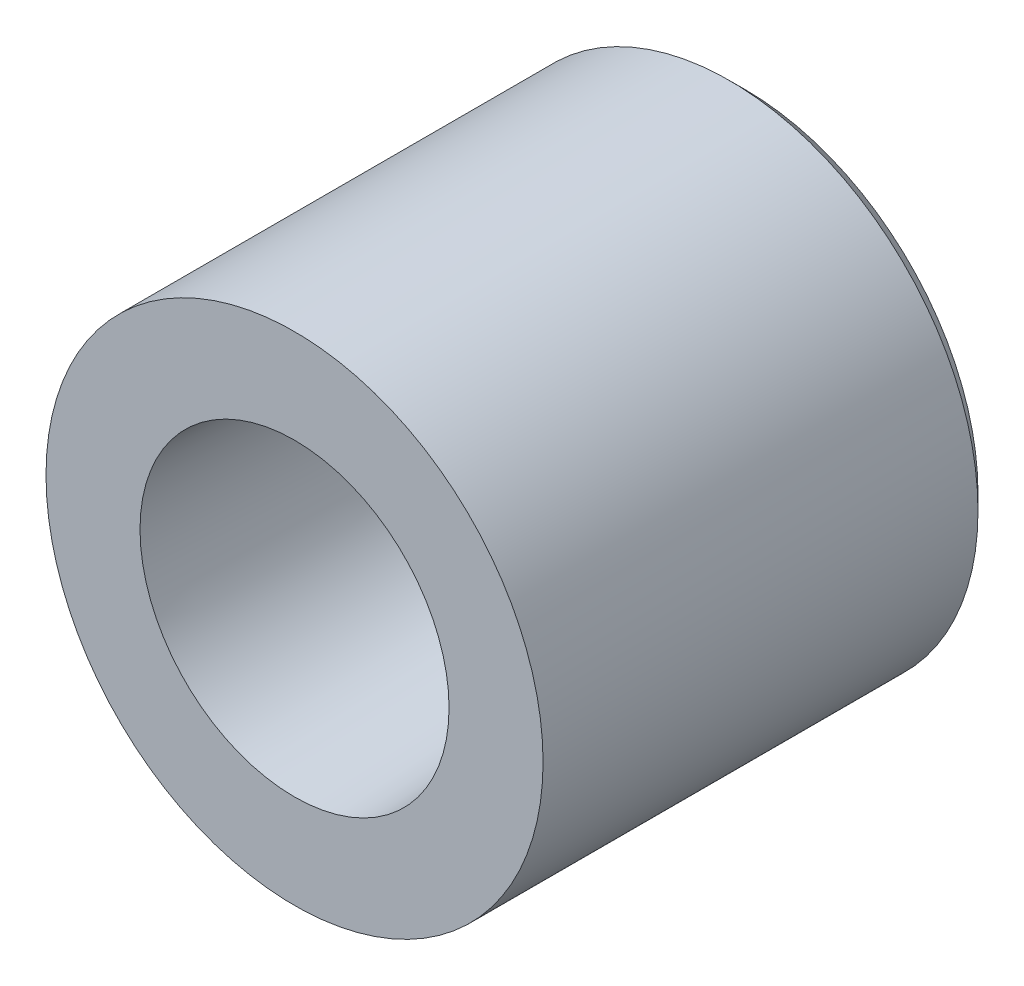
ISO-10303-21;
HEADER;
FILE_DESCRIPTION(('STEP AP214'),'2;1');
FILE_NAME('part.step','',(''),(''),'','','');
FILE_SCHEMA(('AUTOMOTIVE_DESIGN { 1 0 10303 214 1 1 1 1 }'));
ENDSEC;
DATA;
#1=APPLICATION_CONTEXT('core data for automotive mechanical design processes');
#2=APPLICATION_PROTOCOL_DEFINITION('international standard','automotive_design',2000,#1);
#3=PRODUCT_CONTEXT('',#1,'mechanical');
#4=PRODUCT('Part','Part','',(#3));
#5=PRODUCT_RELATED_PRODUCT_CATEGORY('part','',(#4));
#6=PRODUCT_DEFINITION_FORMATION('','',#4);
#7=PRODUCT_DEFINITION_CONTEXT('part definition',#1,'design');
#8=PRODUCT_DEFINITION('design','',#6,#7);
#9=PRODUCT_DEFINITION_SHAPE('','',#8);
#10=(LENGTH_UNIT() NAMED_UNIT(*) SI_UNIT(.MILLI.,.METRE.));
#11=(NAMED_UNIT(*) PLANE_ANGLE_UNIT() SI_UNIT($,.RADIAN.));
#12=(NAMED_UNIT(*) SI_UNIT($,.STERADIAN.) SOLID_ANGLE_UNIT());
#13=UNCERTAINTY_MEASURE_WITH_UNIT(LENGTH_MEASURE(1.E-05),#10,'distance_accuracy_value','');
#14=(GEOMETRIC_REPRESENTATION_CONTEXT(3) GLOBAL_UNCERTAINTY_ASSIGNED_CONTEXT((#13)) GLOBAL_UNIT_ASSIGNED_CONTEXT((#10,
#11,#12)) REPRESENTATION_CONTEXT('',''));
#15=CARTESIAN_POINT('',(0.,0.,0.));
#16=DIRECTION('',(0.,0.,1.));
#17=DIRECTION('',(1.,0.,0.));
#18=AXIS2_PLACEMENT_3D('',#15,#16,#17);
#19=CARTESIAN_POINT('',(0.,0.,-13.1834845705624));
#20=DIRECTION('',(0.,0.,1.));
#21=DIRECTION('',(1.,0.,0.));
#22=AXIS2_PLACEMENT_3D('',#19,#20,#21);
#23=CONICAL_SURFACE('',#22,13.030398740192,0.785398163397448);
#24=CARTESIAN_POINT('',(-1.25693328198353E-13,0.,-18.));
#25=DIRECTION('',(0.,0.,1.));
#26=DIRECTION('',(-1.,0.,0.));
#27=AXIS2_PLACEMENT_3D('',#24,#25,#26);
#28=CIRCLE('',#27,8.21388331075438);
#29=CARTESIAN_POINT('',(8.21388331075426,0.,-18.));
#30=VERTEX_POINT('',#29);
#31=CARTESIAN_POINT('',(-8.21388331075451,0.,-18.));
#32=VERTEX_POINT('',#31);
#33=EDGE_CURVE('E143',#30,#32,#28,.T.);
#34=ORIENTED_EDGE('',*,*,#33,.F.);
#35=CARTESIAN_POINT('',(8.21388480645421,0.,-17.9999985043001));
#36=CARTESIAN_POINT('',(9.21388629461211,0.,-16.9999970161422));
#37=B_SPLINE_CURVE_WITH_KNOTS('',1,(#35,#36),.UNSPECIFIED.,.F.,.F.,(2,2),(0.630363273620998,
0.707107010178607),.UNSPECIFIED.);
#38=CARTESIAN_POINT('',(9.21388331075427,0.,-17.));
#39=VERTEX_POINT('',#38);
#40=EDGE_CURVE('E44',#30,#39,#37,.T.);
#41=ORIENTED_EDGE('',*,*,#40,.T.);
#42=CARTESIAN_POINT('',(-1.18710365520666E-13,0.,-17.));
#43=DIRECTION('',(0.,0.,-1.));
#44=DIRECTION('',(-1.,0.,0.));
#45=AXIS2_PLACEMENT_3D('',#42,#43,#44);
#46=CIRCLE('',#45,9.21388331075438);
#47=CARTESIAN_POINT('',(-9.2138833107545,0.,-17.));
#48=VERTEX_POINT('',#47);
#49=EDGE_CURVE('E11',#48,#39,#46,.T.);
#50=ORIENTED_EDGE('',*,*,#49,.F.);
#51=CARTESIAN_POINT('',(-1.18710365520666E-13,0.,-17.));
#52=DIRECTION('',(0.,0.,-1.));
#53=DIRECTION('',(-1.,0.,0.));
#54=AXIS2_PLACEMENT_3D('',#51,#52,#53);
#55=CIRCLE('',#54,9.21388331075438);
#56=EDGE_CURVE('E51',#39,#48,#55,.T.);
#57=ORIENTED_EDGE('',*,*,#56,.F.);
#58=ORIENTED_EDGE('',*,*,#40,.F.);
#59=CARTESIAN_POINT('',(-1.25693328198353E-13,0.,-18.));
#60=DIRECTION('',(0.,0.,1.));
#61=DIRECTION('',(-1.,0.,0.));
#62=AXIS2_PLACEMENT_3D('',#59,#60,#61);
#63=CIRCLE('',#62,8.21388331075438);
#64=EDGE_CURVE('E59',#32,#30,#63,.T.);
#65=ORIENTED_EDGE('',*,*,#64,.F.);
#66=EDGE_LOOP('',(#34,#41,#50,#57,#58,#65));
#67=FACE_BOUND('',#66,.T.);
#68=ADVANCED_FACE('F36',(#67),#23,.F.);
#69=CARTESIAN_POINT('',(-1.15218884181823E-13,0.,-16.5));
#70=DIRECTION('',(0.,0.,-1.));
#71=DIRECTION('',(-1.,0.,0.));
#72=AXIS2_PLACEMENT_3D('',#69,#70,#71);
#73=CYLINDRICAL_SURFACE('',#72,9.21388331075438);
#74=CARTESIAN_POINT('',(-1.04744440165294E-13,0.,-15.));
#75=DIRECTION('',(0.,0.,-1.));
#76=DIRECTION('',(-1.,0.,0.));
#77=AXIS2_PLACEMENT_3D('',#74,#75,#76);
#78=CIRCLE('',#77,9.21388331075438);
#79=CARTESIAN_POINT('',(-9.21388331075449,0.,-15.));
#80=VERTEX_POINT('',#79);
#81=EDGE_CURVE('E152',#80,#80,#78,.T.);
#82=ORIENTED_EDGE('',*,*,#81,.F.);
#83=CARTESIAN_POINT('',(-9.21388331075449,0.,-14.9999969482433));
#84=CARTESIAN_POINT('',(-9.2138833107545,0.,-17.0000020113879));
#85=B_SPLINE_CURVE_WITH_KNOTS('',1,(#83,#84),.UNSPECIFIED.,.F.,.F.,(2,2),(0.0833320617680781,
0.91666750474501),.UNSPECIFIED.);
#86=EDGE_CURVE('E147',#80,#48,#85,.T.);
#87=ORIENTED_EDGE('',*,*,#86,.T.);
#88=ORIENTED_EDGE('',*,*,#49,.T.);
#89=ORIENTED_EDGE('',*,*,#56,.T.);
#90=ORIENTED_EDGE('',*,*,#86,.F.);
#91=EDGE_LOOP('',(#82,#87,#88,#89,#90));
#92=FACE_BOUND('',#91,.T.);
#93=ADVANCED_FACE('F191',(#92),#73,.F.);
#94=CARTESIAN_POINT('',(18.8919316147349,-17.0722358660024,-18.));
#95=DIRECTION('',(0.,0.,-1.));
#96=DIRECTION('',(-1.,0.,0.));
#97=AXIS2_PLACEMENT_3D('',#94,#95,#96);
#98=PLANE('',#97);
#99=CARTESIAN_POINT('',(-2.09488880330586E-13,0.,-17.9999999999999));
#100=DIRECTION('',(0.,0.,-1.));
#101=DIRECTION('',(-1.,0.,0.));
#102=AXIS2_PLACEMENT_3D('',#99,#100,#101);
#103=CIRCLE('',#102,4.24999999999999);
#104=CARTESIAN_POINT('',(-4.2500000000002,0.,-17.9999999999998));
#105=VERTEX_POINT('',#104);
#106=EDGE_CURVE('E103',#105,#105,#103,.T.);
#107=ORIENTED_EDGE('',*,*,#106,.T.);
#108=EDGE_LOOP('',(#107));
#109=FACE_BOUND('',#108,.T.);
#110=ORIENTED_EDGE('',*,*,#64,.T.);
#111=ORIENTED_EDGE('',*,*,#33,.T.);
#112=EDGE_LOOP('',(#110,#111));
#113=FACE_BOUND('',#112,.T.);
#114=ADVANCED_FACE('F193',(#109,#113),#98,.F.);
#115=CARTESIAN_POINT('',(0.,0.,-1.));
#116=DIRECTION('',(0.,0.,1.));
#117=DIRECTION('',(-1.,0.,0.));
#118=AXIS2_PLACEMENT_3D('',#115,#116,#117);
#119=CONICAL_SURFACE('',#118,9.94759222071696,0.0523598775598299);
#120=ORIENTED_EDGE('',*,*,#81,.T.);
#121=CARTESIAN_POINT('',(-9.21388331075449,0.,-15.));
#122=CARTESIAN_POINT('',(-9.94759222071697,0.,-0.999999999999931));
#123=B_SPLINE_CURVE_WITH_KNOTS('',1,(#121,#122),.UNSPECIFIED.,.F.,.F.,(2,2),(0.,1.),.UNSPECIFIED.);
#124=CARTESIAN_POINT('',(-9.94759222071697,0.,-0.999999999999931));
#125=VERTEX_POINT('',#124);
#126=EDGE_CURVE('E108',#80,#125,#123,.T.);
#127=ORIENTED_EDGE('',*,*,#126,.T.);
#128=CARTESIAN_POINT('',(0.,0.,-1.));
#129=DIRECTION('',(0.,0.,-1.));
#130=DIRECTION('',(1.,0.,0.));
#131=AXIS2_PLACEMENT_3D('',#128,#129,#130);
#132=CIRCLE('',#131,9.94759222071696);
#133=CARTESIAN_POINT('',(9.94759222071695,0.,-1.00000000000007));
#134=VERTEX_POINT('',#133);
#135=EDGE_CURVE('E133',#134,#125,#132,.T.);
#136=ORIENTED_EDGE('',*,*,#135,.F.);
#137=CARTESIAN_POINT('',(0.,0.,-1.));
#138=DIRECTION('',(0.,0.,-1.));
#139=DIRECTION('',(1.,0.,0.));
#140=AXIS2_PLACEMENT_3D('',#137,#138,#139);
#141=CIRCLE('',#140,9.94759222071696);
#142=EDGE_CURVE('E126',#125,#134,#141,.T.);
#143=ORIENTED_EDGE('',*,*,#142,.F.);
#144=ORIENTED_EDGE('',*,*,#126,.F.);
#145=EDGE_LOOP('',(#120,#127,#136,#143,#144));
#146=FACE_BOUND('',#145,.T.);
#147=ADVANCED_FACE('F189',(#146),#119,.F.);
#148=CARTESIAN_POINT('',(-1.56226912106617E-13,0.,-22.3725830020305));
#149=DIRECTION('',(0.,0.,1.));
#150=DIRECTION('',(1.,0.,0.));
#151=AXIS2_PLACEMENT_3D('',#148,#149,#150);
#152=CONICAL_SURFACE('',#151,22.6274169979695,0.785398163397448);
#153=CARTESIAN_POINT('',(-2.09488880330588E-13,0.,-30.));
#154=DIRECTION('',(0.,0.,1.));
#155=DIRECTION('',(-1.,0.,0.));
#156=AXIS2_PLACEMENT_3D('',#153,#154,#155);
#157=CIRCLE('',#156,15.);
#158=CARTESIAN_POINT('',(-15.,0.,-30.));
#159=VERTEX_POINT('',#158);
#160=CARTESIAN_POINT('',(14.9999999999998,0.,-30.));
#161=VERTEX_POINT('',#160);
#162=EDGE_CURVE('E90',#159,#161,#157,.T.);
#163=ORIENTED_EDGE('',*,*,#162,.T.);
#164=CARTESIAN_POINT('',(15.0000010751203,0.,-29.9999989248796));
#165=CARTESIAN_POINT('',(16.0000024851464,0.,-28.9999975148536));
#166=B_SPLINE_CURVE_WITH_KNOTS('',1,(#164,#165),.UNSPECIFIED.,.F.,.F.,(2,2),(0.662912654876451,
0.707106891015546),.UNSPECIFIED.);
#167=CARTESIAN_POINT('',(16.,0.,-29.));
#168=VERTEX_POINT('',#167);
#169=EDGE_CURVE('E95',#161,#168,#166,.T.);
#170=ORIENTED_EDGE('',*,*,#169,.T.);
#171=CARTESIAN_POINT('',(-2.02505917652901E-13,0.,-29.));
#172=DIRECTION('',(0.,0.,-1.));
#173=DIRECTION('',(-1.,0.,0.));
#174=AXIS2_PLACEMENT_3D('',#171,#172,#173);
#175=CIRCLE('',#174,16.);
#176=CARTESIAN_POINT('',(-16.,0.,-29.));
#177=VERTEX_POINT('',#176);
#178=EDGE_CURVE('E102',#168,#177,#175,.T.);
#179=ORIENTED_EDGE('',*,*,#178,.T.);
#180=CARTESIAN_POINT('',(-2.02505917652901E-13,0.,-29.));
#181=DIRECTION('',(0.,0.,-1.));
#182=DIRECTION('',(-1.,0.,0.));
#183=AXIS2_PLACEMENT_3D('',#180,#181,#182);
#184=CIRCLE('',#183,16.);
#185=EDGE_CURVE('E105',#177,#168,#184,.T.);
#186=ORIENTED_EDGE('',*,*,#185,.T.);
#187=ORIENTED_EDGE('',*,*,#169,.F.);
#188=CARTESIAN_POINT('',(-2.09488880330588E-13,0.,-30.));
#189=DIRECTION('',(0.,0.,1.));
#190=DIRECTION('',(-1.,0.,0.));
#191=AXIS2_PLACEMENT_3D('',#188,#189,#190);
#192=CIRCLE('',#191,15.);
#193=EDGE_CURVE('E97',#161,#159,#192,.T.);
#194=ORIENTED_EDGE('',*,*,#193,.T.);
#195=EDGE_LOOP('',(#163,#170,#179,#186,#187,#194));
#196=FACE_BOUND('',#195,.T.);
#197=ADVANCED_FACE('F92',(#196),#152,.T.);
#198=CARTESIAN_POINT('',(-1.08235921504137E-13,0.,-15.5));
#199=DIRECTION('',(0.,0.,-1.));
#200=DIRECTION('',(-1.,0.,0.));
#201=AXIS2_PLACEMENT_3D('',#198,#199,#200);
#202=CYLINDRICAL_SURFACE('',#201,16.);
#203=CARTESIAN_POINT('',(0.,0.,-1.));
#204=DIRECTION('',(0.,0.,1.));
#205=DIRECTION('',(-1.,0.,0.));
#206=AXIS2_PLACEMENT_3D('',#203,#204,#205);
#207=CIRCLE('',#206,16.);
#208=CARTESIAN_POINT('',(-16.,0.,-0.999999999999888));
#209=VERTEX_POINT('',#208);
#210=EDGE_CURVE('E99',#209,#209,#207,.T.);
#211=ORIENTED_EDGE('',*,*,#210,.F.);
#212=CARTESIAN_POINT('',(-16.,0.,-0.999998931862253));
#213=CARTESIAN_POINT('',(-16.,0.,-28.9999996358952));
#214=B_SPLINE_CURVE_WITH_KNOTS('',1,(#212,#213),.UNSPECIFIED.,.F.,.F.,(2,2),(0.0833333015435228,
0.916666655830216),.UNSPECIFIED.);
#215=EDGE_CURVE('E173',#209,#177,#214,.T.);
#216=ORIENTED_EDGE('',*,*,#215,.T.);
#217=ORIENTED_EDGE('',*,*,#178,.F.);
#218=ORIENTED_EDGE('',*,*,#185,.F.);
#219=ORIENTED_EDGE('',*,*,#215,.F.);
#220=EDGE_LOOP('',(#211,#216,#217,#218,#219));
#221=FACE_BOUND('',#220,.T.);
#222=ADVANCED_FACE('F225',(#221),#202,.T.);
#223=CARTESIAN_POINT('',(34.5,-31.1769145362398,-30.));
#224=DIRECTION('',(0.,0.,-1.));
#225=DIRECTION('',(-1.,0.,0.));
#226=AXIS2_PLACEMENT_3D('',#223,#224,#225);
#227=PLANE('',#226);
#228=CARTESIAN_POINT('',(-2.09488880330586E-13,0.,-29.9999999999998));
#229=DIRECTION('',(0.,0.,-1.));
#230=DIRECTION('',(-1.,0.,0.));
#231=AXIS2_PLACEMENT_3D('',#228,#229,#230);
#232=CIRCLE('',#231,4.24999999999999);
#233=CARTESIAN_POINT('',(-4.2500000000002,0.,-29.9999999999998));
#234=VERTEX_POINT('',#233);
#235=EDGE_CURVE('E275',#234,#234,#232,.T.);
#236=ORIENTED_EDGE('',*,*,#235,.F.);
#237=EDGE_LOOP('',(#236));
#238=FACE_BOUND('',#237,.T.);
#239=ORIENTED_EDGE('',*,*,#193,.F.);
#240=ORIENTED_EDGE('',*,*,#162,.F.);
#241=EDGE_LOOP('',(#239,#240));
#242=FACE_BOUND('',#241,.T.);
#243=ADVANCED_FACE('F101',(#238,#242),#227,.T.);
#244=CARTESIAN_POINT('',(-20.8,-33.2553755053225,-0.999999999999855));
#245=DIRECTION('',(0.,0.,1.));
#246=DIRECTION('',(1.,0.,0.));
#247=AXIS2_PLACEMENT_3D('',#244,#245,#246);
#248=PLANE('',#247);
#249=ORIENTED_EDGE('',*,*,#210,.T.);
#250=EDGE_LOOP('',(#249));
#251=FACE_BOUND('',#250,.T.);
#252=ORIENTED_EDGE('',*,*,#135,.T.);
#253=ORIENTED_EDGE('',*,*,#142,.T.);
#254=EDGE_LOOP('',(#252,#253));
#255=FACE_BOUND('',#254,.T.);
#256=ADVANCED_FACE('F240',(#251,#255),#248,.T.);
#257=CARTESIAN_POINT('',(-2.09488880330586E-13,0.,-29.9999999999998));
#258=DIRECTION('',(0.,0.,-1.));
#259=DIRECTION('',(-1.,0.,0.));
#260=AXIS2_PLACEMENT_3D('',#257,#258,#259);
#261=CYLINDRICAL_SURFACE('',#260,4.24999999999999);
#262=ORIENTED_EDGE('',*,*,#235,.T.);
#263=EDGE_LOOP('',(#262));
#264=FACE_BOUND('',#263,.T.);
#265=ORIENTED_EDGE('',*,*,#106,.F.);
#266=EDGE_LOOP('',(#265));
#267=FACE_BOUND('',#266,.T.);
#268=ADVANCED_FACE('F248',(#264,#267),#261,.F.);
#269=CLOSED_SHELL('',(#68,#93,#114,#147,#197,#222,#243,#256,#268));
#270=MANIFOLD_SOLID_BREP('B2',#269);
#271=ADVANCED_BREP_SHAPE_REPRESENTATION('',(#18,#270),#14);
#272=SHAPE_DEFINITION_REPRESENTATION(#9,#271);
ENDSEC;
END-ISO-10303-21;
